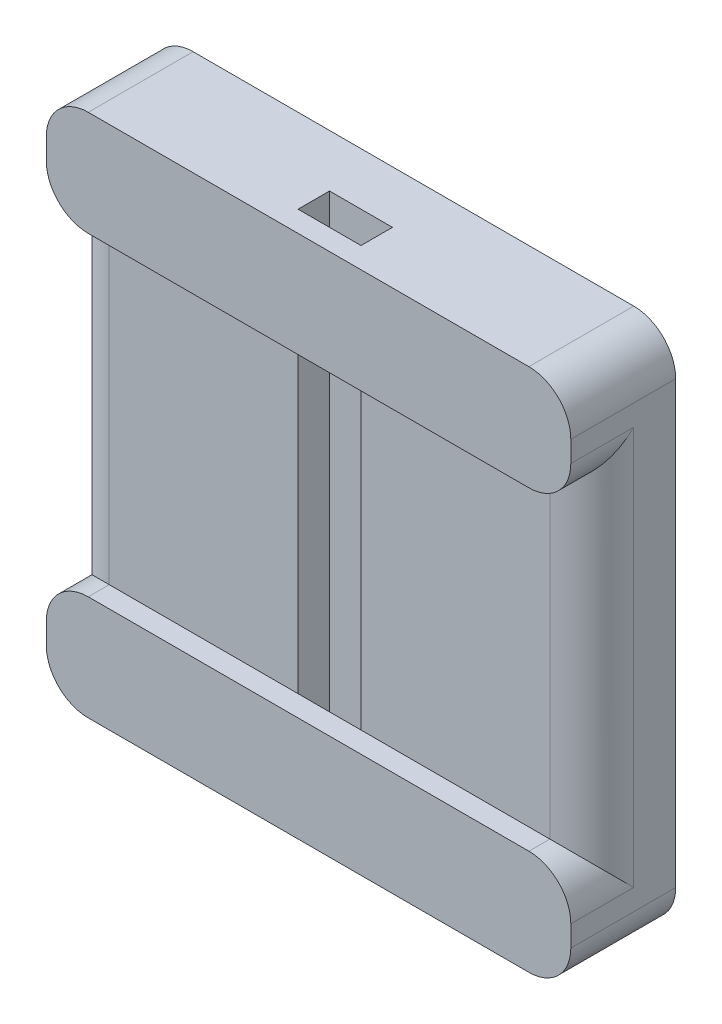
ISO-10303-21;
HEADER;
FILE_DESCRIPTION(('STEP AP214'),'2;1');
FILE_NAME('part.step','',(''),(''),'','','');
FILE_SCHEMA(('AUTOMOTIVE_DESIGN { 1 0 10303 214 1 1 1 1 }'));
ENDSEC;
DATA;
#1=APPLICATION_CONTEXT('core data for automotive mechanical design processes');
#2=APPLICATION_PROTOCOL_DEFINITION('international standard','automotive_design',2000,#1);
#3=PRODUCT_CONTEXT('',#1,'mechanical');
#4=PRODUCT('Part','Part','',(#3));
#5=PRODUCT_RELATED_PRODUCT_CATEGORY('part','',(#4));
#6=PRODUCT_DEFINITION_FORMATION('','',#4);
#7=PRODUCT_DEFINITION_CONTEXT('part definition',#1,'design');
#8=PRODUCT_DEFINITION('design','',#6,#7);
#9=PRODUCT_DEFINITION_SHAPE('','',#8);
#10=(LENGTH_UNIT() NAMED_UNIT(*) SI_UNIT(.MILLI.,.METRE.));
#11=(NAMED_UNIT(*) PLANE_ANGLE_UNIT() SI_UNIT($,.RADIAN.));
#12=(NAMED_UNIT(*) SI_UNIT($,.STERADIAN.) SOLID_ANGLE_UNIT());
#13=UNCERTAINTY_MEASURE_WITH_UNIT(LENGTH_MEASURE(1.E-05),#10,'distance_accuracy_value','');
#14=(GEOMETRIC_REPRESENTATION_CONTEXT(3) GLOBAL_UNCERTAINTY_ASSIGNED_CONTEXT((#13)) GLOBAL_UNIT_ASSIGNED_CONTEXT((#10,
#11,#12)) REPRESENTATION_CONTEXT('',''));
#15=CARTESIAN_POINT('',(0.,0.,0.));
#16=DIRECTION('',(0.,0.,1.));
#17=DIRECTION('',(1.,0.,0.));
#18=AXIS2_PLACEMENT_3D('',#15,#16,#17);
#19=CARTESIAN_POINT('',(0.,0.,4.));
#20=DIRECTION('',(0.,0.,-1.));
#21=DIRECTION('',(-1.,0.,0.));
#22=AXIS2_PLACEMENT_3D('',#19,#20,#21);
#23=PLANE('',#22);
#24=DIRECTION('',(1.,0.,0.));
#25=VECTOR('',#24,1.);
#26=CARTESIAN_POINT('',(0.,20.,4.));
#27=LINE('',#26,#25);
#28=CARTESIAN_POINT('',(2.,20.,4.));
#29=VERTEX_POINT('',#28);
#30=CARTESIAN_POINT('',(11.,20.,4.));
#31=VERTEX_POINT('',#30);
#32=EDGE_CURVE('E257',#29,#31,#27,.T.);
#33=ORIENTED_EDGE('',*,*,#32,.F.);
#34=DIRECTION('',(0.,-1.,0.));
#35=VECTOR('',#34,1.);
#36=CARTESIAN_POINT('',(2.,0.,4.));
#37=LINE('',#36,#35);
#38=CARTESIAN_POINT('',(2.,5.,4.));
#39=VERTEX_POINT('',#38);
#40=EDGE_CURVE('E341',#29,#39,#37,.T.);
#41=ORIENTED_EDGE('',*,*,#40,.T.);
#42=DIRECTION('',(-1.,0.,0.));
#43=VECTOR('',#42,1.);
#44=CARTESIAN_POINT('',(0.,5.,4.));
#45=LINE('',#44,#43);
#46=CARTESIAN_POINT('',(11.,5.,4.));
#47=VERTEX_POINT('',#46);
#48=EDGE_CURVE('E236',#47,#39,#45,.T.);
#49=ORIENTED_EDGE('',*,*,#48,.F.);
#50=DIRECTION('',(0.,-1.,0.));
#51=VECTOR('',#50,1.);
#52=CARTESIAN_POINT('',(11.,25.,4.));
#53=LINE('',#52,#51);
#54=EDGE_CURVE('E228',#31,#47,#53,.T.);
#55=ORIENTED_EDGE('',*,*,#54,.F.);
#56=EDGE_LOOP('',(#33,#41,#49,#55));
#57=FACE_BOUND('',#56,.T.);
#58=ADVANCED_FACE('F33',(#57),#23,.F.);
#59=CARTESIAN_POINT('',(23.,5.,4.));
#60=VERTEX_POINT('',#59);
#61=CARTESIAN_POINT('',(14.,5.,4.));
#62=VERTEX_POINT('',#61);
#63=EDGE_CURVE('E241',#60,#62,#45,.T.);
#64=ORIENTED_EDGE('',*,*,#63,.F.);
#65=DIRECTION('',(0.,1.,0.));
#66=VECTOR('',#65,1.);
#67=CARTESIAN_POINT('',(23.,0.,4.));
#68=LINE('',#67,#66);
#69=CARTESIAN_POINT('',(23.,20.,4.));
#70=VERTEX_POINT('',#69);
#71=EDGE_CURVE('E11',#60,#70,#68,.T.);
#72=ORIENTED_EDGE('',*,*,#71,.T.);
#73=CARTESIAN_POINT('',(14.,20.,4.));
#74=VERTEX_POINT('',#73);
#75=EDGE_CURVE('E250',#74,#70,#27,.T.);
#76=ORIENTED_EDGE('',*,*,#75,.F.);
#77=DIRECTION('',(0.,-1.,0.));
#78=VECTOR('',#77,1.);
#79=CARTESIAN_POINT('',(14.,25.,4.));
#80=LINE('',#79,#78);
#81=EDGE_CURVE('E233',#74,#62,#80,.T.);
#82=ORIENTED_EDGE('',*,*,#81,.T.);
#83=EDGE_LOOP('',(#64,#72,#76,#82));
#84=FACE_BOUND('',#83,.T.);
#85=ADVANCED_FACE('F412',(#84),#23,.F.);
#86=CARTESIAN_POINT('',(0.,0.,4.));
#87=DIRECTION('',(1.,0.,0.));
#88=DIRECTION('',(0.,0.,-1.));
#89=AXIS2_PLACEMENT_3D('',#86,#87,#88);
#90=PLANE('',#89);
#91=DIRECTION('',(0.,-1.,0.));
#92=VECTOR('',#91,1.);
#93=CARTESIAN_POINT('',(0.,25.,5.));
#94=LINE('',#93,#92);
#95=CARTESIAN_POINT('',(0.,23.,5.));
#96=VERTEX_POINT('',#95);
#97=CARTESIAN_POINT('',(0.,22.,5.));
#98=VERTEX_POINT('',#97);
#99=EDGE_CURVE('E253',#96,#98,#94,.T.);
#100=ORIENTED_EDGE('',*,*,#99,.F.);
#101=DIRECTION('',(0.,0.,-1.));
#102=VECTOR('',#101,1.);
#103=CARTESIAN_POINT('',(0.,23.,4.));
#104=LINE('',#103,#102);
#105=CARTESIAN_POINT('',(0.,23.,0.));
#106=VERTEX_POINT('',#105);
#107=EDGE_CURVE('E288',#96,#106,#104,.T.);
#108=ORIENTED_EDGE('',*,*,#107,.T.);
#109=DIRECTION('',(0.,-1.,0.));
#110=VECTOR('',#109,1.);
#111=CARTESIAN_POINT('',(0.,0.,0.));
#112=LINE('',#111,#110);
#113=CARTESIAN_POINT('',(0.,2.,0.));
#114=VERTEX_POINT('',#113);
#115=EDGE_CURVE('E266',#106,#114,#112,.T.);
#116=ORIENTED_EDGE('',*,*,#115,.T.);
#117=DIRECTION('',(0.,0.,-1.));
#118=VECTOR('',#117,1.);
#119=CARTESIAN_POINT('',(0.,2.,4.));
#120=LINE('',#119,#118);
#121=CARTESIAN_POINT('',(0.,2.,5.));
#122=VERTEX_POINT('',#121);
#123=EDGE_CURVE('E286',#114,#122,#120,.F.);
#124=ORIENTED_EDGE('',*,*,#123,.T.);
#125=DIRECTION('',(0.,-1.,0.));
#126=VECTOR('',#125,1.);
#127=CARTESIAN_POINT('',(0.,0.,5.));
#128=LINE('',#127,#126);
#129=CARTESIAN_POINT('',(0.,3.,5.));
#130=VERTEX_POINT('',#129);
#131=EDGE_CURVE('E237',#130,#122,#128,.T.);
#132=ORIENTED_EDGE('',*,*,#131,.F.);
#133=DIRECTION('',(0.,0.,-1.));
#134=VECTOR('',#133,1.);
#135=CARTESIAN_POINT('',(0.,3.,4.));
#136=LINE('',#135,#134);
#137=CARTESIAN_POINT('',(0.,3.,2.));
#138=VERTEX_POINT('',#137);
#139=EDGE_CURVE('E283',#130,#138,#136,.T.);
#140=ORIENTED_EDGE('',*,*,#139,.T.);
#141=DIRECTION('',(0.,-1.,0.));
#142=VECTOR('',#141,1.);
#143=CARTESIAN_POINT('',(0.,0.,2.));
#144=LINE('',#143,#142);
#145=CARTESIAN_POINT('',(0.,22.,2.));
#146=VERTEX_POINT('',#145);
#147=EDGE_CURVE('E281',#138,#146,#144,.F.);
#148=ORIENTED_EDGE('',*,*,#147,.T.);
#149=DIRECTION('',(0.,0.,-1.));
#150=VECTOR('',#149,1.);
#151=CARTESIAN_POINT('',(0.,22.,4.));
#152=LINE('',#151,#150);
#153=EDGE_CURVE('E279',#146,#98,#152,.F.);
#154=ORIENTED_EDGE('',*,*,#153,.T.);
#155=EDGE_LOOP('',(#100,#108,#116,#124,#132,#140,#148,#154));
#156=FACE_BOUND('',#155,.T.);
#157=ADVANCED_FACE('F396',(#156),#90,.F.);
#158=CARTESIAN_POINT('',(0.,0.,4.));
#159=DIRECTION('',(0.,1.,0.));
#160=DIRECTION('',(0.,0.,1.));
#161=AXIS2_PLACEMENT_3D('',#158,#159,#160);
#162=PLANE('',#161);
#163=DIRECTION('',(1.,0.,0.));
#164=VECTOR('',#163,1.);
#165=CARTESIAN_POINT('',(11.,0.,2.50000000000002));
#166=LINE('',#165,#164);
#167=CARTESIAN_POINT('',(11.,0.,2.50000000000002));
#168=VERTEX_POINT('',#167);
#169=CARTESIAN_POINT('',(14.,0.,2.50000000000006));
#170=VERTEX_POINT('',#169);
#171=EDGE_CURVE('E211',#168,#170,#166,.T.);
#172=ORIENTED_EDGE('',*,*,#171,.F.);
#173=DIRECTION('',(0.,0.,-1.));
#174=VECTOR('',#173,1.);
#175=CARTESIAN_POINT('',(11.,0.,4.));
#176=LINE('',#175,#174);
#177=CARTESIAN_POINT('',(11.,0.,4.));
#178=VERTEX_POINT('',#177);
#179=EDGE_CURVE('E202',#178,#168,#176,.T.);
#180=ORIENTED_EDGE('',*,*,#179,.F.);
#181=DIRECTION('',(-1.,0.,0.));
#182=VECTOR('',#181,1.);
#183=CARTESIAN_POINT('',(11.,0.,4.));
#184=LINE('',#183,#182);
#185=CARTESIAN_POINT('',(14.,0.,4.));
#186=VERTEX_POINT('',#185);
#187=EDGE_CURVE('E196',#186,#178,#184,.T.);
#188=ORIENTED_EDGE('',*,*,#187,.F.);
#189=DIRECTION('',(0.,0.,1.));
#190=VECTOR('',#189,1.);
#191=CARTESIAN_POINT('',(14.,0.,4.));
#192=LINE('',#191,#190);
#193=EDGE_CURVE('E221',#170,#186,#192,.T.);
#194=ORIENTED_EDGE('',*,*,#193,.F.);
#195=EDGE_LOOP('',(#172,#180,#188,#194));
#196=FACE_BOUND('',#195,.T.);
#197=DIRECTION('',(1.,0.,0.));
#198=VECTOR('',#197,1.);
#199=CARTESIAN_POINT('',(0.,0.,0.));
#200=LINE('',#199,#198);
#201=CARTESIAN_POINT('',(2.,0.,0.));
#202=VERTEX_POINT('',#201);
#203=CARTESIAN_POINT('',(23.,0.,0.));
#204=VERTEX_POINT('',#203);
#205=EDGE_CURVE('E270',#202,#204,#200,.T.);
#206=ORIENTED_EDGE('',*,*,#205,.T.);
#207=DIRECTION('',(0.,0.,-1.));
#208=VECTOR('',#207,1.);
#209=CARTESIAN_POINT('',(23.,0.,4.));
#210=LINE('',#209,#208);
#211=CARTESIAN_POINT('',(23.,0.,5.));
#212=VERTEX_POINT('',#211);
#213=EDGE_CURVE('E327',#204,#212,#210,.F.);
#214=ORIENTED_EDGE('',*,*,#213,.T.);
#215=DIRECTION('',(1.,0.,0.));
#216=VECTOR('',#215,1.);
#217=CARTESIAN_POINT('',(25.,0.,5.));
#218=LINE('',#217,#216);
#219=CARTESIAN_POINT('',(2.,0.,5.));
#220=VERTEX_POINT('',#219);
#221=EDGE_CURVE('E240',#220,#212,#218,.T.);
#222=ORIENTED_EDGE('',*,*,#221,.F.);
#223=DIRECTION('',(0.,0.,-1.));
#224=VECTOR('',#223,1.);
#225=CARTESIAN_POINT('',(2.,0.,4.));
#226=LINE('',#225,#224);
#227=EDGE_CURVE('E324',#220,#202,#226,.T.);
#228=ORIENTED_EDGE('',*,*,#227,.T.);
#229=EDGE_LOOP('',(#206,#214,#222,#228));
#230=FACE_BOUND('',#229,.T.);
#231=ADVANCED_FACE('F403',(#196,#230),#162,.F.);
#232=CARTESIAN_POINT('',(25.,0.,4.));
#233=DIRECTION('',(-1.,0.,0.));
#234=DIRECTION('',(0.,0.,1.));
#235=AXIS2_PLACEMENT_3D('',#232,#233,#234);
#236=PLANE('',#235);
#237=DIRECTION('',(0.,1.,0.));
#238=VECTOR('',#237,1.);
#239=CARTESIAN_POINT('',(25.,0.,0.));
#240=LINE('',#239,#238);
#241=CARTESIAN_POINT('',(25.,2.,0.));
#242=VERTEX_POINT('',#241);
#243=CARTESIAN_POINT('',(25.,23.,0.));
#244=VERTEX_POINT('',#243);
#245=EDGE_CURVE('E273',#242,#244,#240,.T.);
#246=ORIENTED_EDGE('',*,*,#245,.T.);
#247=DIRECTION('',(0.,0.,-1.));
#248=VECTOR('',#247,1.);
#249=CARTESIAN_POINT('',(25.,23.,4.));
#250=LINE('',#249,#248);
#251=CARTESIAN_POINT('',(25.,23.,5.));
#252=VERTEX_POINT('',#251);
#253=EDGE_CURVE('E322',#244,#252,#250,.F.);
#254=ORIENTED_EDGE('',*,*,#253,.T.);
#255=DIRECTION('',(0.,1.,0.));
#256=VECTOR('',#255,1.);
#257=CARTESIAN_POINT('',(25.,20.,5.));
#258=LINE('',#257,#256);
#259=CARTESIAN_POINT('',(25.,22.,5.));
#260=VERTEX_POINT('',#259);
#261=EDGE_CURVE('E260',#260,#252,#258,.T.);
#262=ORIENTED_EDGE('',*,*,#261,.F.);
#263=DIRECTION('',(0.,0.,-1.));
#264=VECTOR('',#263,1.);
#265=CARTESIAN_POINT('',(25.,22.,4.));
#266=LINE('',#265,#264);
#267=CARTESIAN_POINT('',(25.,22.,2.));
#268=VERTEX_POINT('',#267);
#269=EDGE_CURVE('E316',#260,#268,#266,.T.);
#270=ORIENTED_EDGE('',*,*,#269,.T.);
#271=DIRECTION('',(0.,1.,0.));
#272=VECTOR('',#271,1.);
#273=CARTESIAN_POINT('',(25.,0.,2.));
#274=LINE('',#273,#272);
#275=CARTESIAN_POINT('',(25.,3.,2.));
#276=VERTEX_POINT('',#275);
#277=EDGE_CURVE('E314',#268,#276,#274,.F.);
#278=ORIENTED_EDGE('',*,*,#277,.T.);
#279=DIRECTION('',(0.,0.,-1.));
#280=VECTOR('',#279,1.);
#281=CARTESIAN_POINT('',(25.,3.,4.));
#282=LINE('',#281,#280);
#283=CARTESIAN_POINT('',(25.,3.,5.));
#284=VERTEX_POINT('',#283);
#285=EDGE_CURVE('E312',#276,#284,#282,.F.);
#286=ORIENTED_EDGE('',*,*,#285,.T.);
#287=DIRECTION('',(0.,1.,0.));
#288=VECTOR('',#287,1.);
#289=CARTESIAN_POINT('',(25.,5.,5.));
#290=LINE('',#289,#288);
#291=CARTESIAN_POINT('',(25.,2.,5.));
#292=VERTEX_POINT('',#291);
#293=EDGE_CURVE('E244',#292,#284,#290,.T.);
#294=ORIENTED_EDGE('',*,*,#293,.F.);
#295=DIRECTION('',(0.,0.,-1.));
#296=VECTOR('',#295,1.);
#297=CARTESIAN_POINT('',(25.,2.,4.));
#298=LINE('',#297,#296);
#299=EDGE_CURVE('E319',#292,#242,#298,.T.);
#300=ORIENTED_EDGE('',*,*,#299,.T.);
#301=EDGE_LOOP('',(#246,#254,#262,#270,#278,#286,#294,#300));
#302=FACE_BOUND('',#301,.T.);
#303=ADVANCED_FACE('F365',(#302),#236,.F.);
#304=CARTESIAN_POINT('',(0.,25.,4.));
#305=DIRECTION('',(0.,-1.,0.));
#306=DIRECTION('',(0.,0.,-1.));
#307=AXIS2_PLACEMENT_3D('',#304,#305,#306);
#308=PLANE('',#307);
#309=DIRECTION('',(0.,0.,-1.));
#310=VECTOR('',#309,1.);
#311=CARTESIAN_POINT('',(11.,25.,4.));
#312=LINE('',#311,#310);
#313=CARTESIAN_POINT('',(11.,25.,4.));
#314=VERTEX_POINT('',#313);
#315=CARTESIAN_POINT('',(11.,25.,2.50000000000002));
#316=VERTEX_POINT('',#315);
#317=EDGE_CURVE('E185',#314,#316,#312,.T.);
#318=ORIENTED_EDGE('',*,*,#317,.T.);
#319=DIRECTION('',(1.,0.,0.));
#320=VECTOR('',#319,1.);
#321=CARTESIAN_POINT('',(11.,25.,2.50000000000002));
#322=LINE('',#321,#320);
#323=CARTESIAN_POINT('',(14.,25.,2.50000000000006));
#324=VERTEX_POINT('',#323);
#325=EDGE_CURVE('E190',#316,#324,#322,.T.);
#326=ORIENTED_EDGE('',*,*,#325,.T.);
#327=DIRECTION('',(0.,0.,1.));
#328=VECTOR('',#327,1.);
#329=CARTESIAN_POINT('',(14.,25.,4.));
#330=LINE('',#329,#328);
#331=CARTESIAN_POINT('',(14.,25.,4.));
#332=VERTEX_POINT('',#331);
#333=EDGE_CURVE('E195',#324,#332,#330,.T.);
#334=ORIENTED_EDGE('',*,*,#333,.T.);
#335=DIRECTION('',(-1.,0.,0.));
#336=VECTOR('',#335,1.);
#337=CARTESIAN_POINT('',(11.,25.,4.));
#338=LINE('',#337,#336);
#339=EDGE_CURVE('E192',#332,#314,#338,.T.);
#340=ORIENTED_EDGE('',*,*,#339,.T.);
#341=EDGE_LOOP('',(#318,#326,#334,#340));
#342=FACE_BOUND('',#341,.T.);
#343=DIRECTION('',(-1.,0.,0.));
#344=VECTOR('',#343,1.);
#345=CARTESIAN_POINT('',(0.,25.,0.));
#346=LINE('',#345,#344);
#347=CARTESIAN_POINT('',(23.,25.,0.));
#348=VERTEX_POINT('',#347);
#349=CARTESIAN_POINT('',(2.,25.,0.));
#350=VERTEX_POINT('',#349);
#351=EDGE_CURVE('E276',#348,#350,#346,.T.);
#352=ORIENTED_EDGE('',*,*,#351,.T.);
#353=DIRECTION('',(0.,0.,-1.));
#354=VECTOR('',#353,1.);
#355=CARTESIAN_POINT('',(2.,25.,4.));
#356=LINE('',#355,#354);
#357=CARTESIAN_POINT('',(2.,25.,5.));
#358=VERTEX_POINT('',#357);
#359=EDGE_CURVE('E302',#350,#358,#356,.F.);
#360=ORIENTED_EDGE('',*,*,#359,.T.);
#361=DIRECTION('',(-1.,0.,0.));
#362=VECTOR('',#361,1.);
#363=CARTESIAN_POINT('',(25.,25.,5.));
#364=LINE('',#363,#362);
#365=CARTESIAN_POINT('',(23.,25.,5.));
#366=VERTEX_POINT('',#365);
#367=EDGE_CURVE('E263',#366,#358,#364,.T.);
#368=ORIENTED_EDGE('',*,*,#367,.F.);
#369=DIRECTION('',(0.,0.,-1.));
#370=VECTOR('',#369,1.);
#371=CARTESIAN_POINT('',(23.,25.,4.));
#372=LINE('',#371,#370);
#373=EDGE_CURVE('E299',#366,#348,#372,.T.);
#374=ORIENTED_EDGE('',*,*,#373,.T.);
#375=EDGE_LOOP('',(#352,#360,#368,#374));
#376=FACE_BOUND('',#375,.T.);
#377=ADVANCED_FACE('F187',(#342,#376),#308,.F.);
#378=CARTESIAN_POINT('',(0.,0.,0.));
#379=DIRECTION('',(0.,0.,-1.));
#380=DIRECTION('',(-1.,0.,0.));
#381=AXIS2_PLACEMENT_3D('',#378,#379,#380);
#382=PLANE('',#381);
#383=ORIENTED_EDGE('',*,*,#115,.F.);
#384=CARTESIAN_POINT('',(2.,23.,0.));
#385=DIRECTION('',(0.,0.,-1.));
#386=DIRECTION('',(-1.,0.,0.));
#387=AXIS2_PLACEMENT_3D('',#384,#385,#386);
#388=CIRCLE('',#387,2.);
#389=EDGE_CURVE('E297',#106,#350,#388,.T.);
#390=ORIENTED_EDGE('',*,*,#389,.T.);
#391=ORIENTED_EDGE('',*,*,#351,.F.);
#392=CARTESIAN_POINT('',(23.,23.,0.));
#393=DIRECTION('',(0.,0.,-1.));
#394=DIRECTION('',(-1.,0.,0.));
#395=AXIS2_PLACEMENT_3D('',#392,#393,#394);
#396=CIRCLE('',#395,2.);
#397=EDGE_CURVE('E295',#348,#244,#396,.T.);
#398=ORIENTED_EDGE('',*,*,#397,.T.);
#399=ORIENTED_EDGE('',*,*,#245,.F.);
#400=CARTESIAN_POINT('',(23.,2.,0.));
#401=DIRECTION('',(0.,0.,-1.));
#402=DIRECTION('',(-1.,0.,0.));
#403=AXIS2_PLACEMENT_3D('',#400,#401,#402);
#404=CIRCLE('',#403,2.);
#405=EDGE_CURVE('E293',#242,#204,#404,.T.);
#406=ORIENTED_EDGE('',*,*,#405,.T.);
#407=ORIENTED_EDGE('',*,*,#205,.F.);
#408=CARTESIAN_POINT('',(2.,2.,0.));
#409=DIRECTION('',(0.,0.,-1.));
#410=DIRECTION('',(-1.,0.,0.));
#411=AXIS2_PLACEMENT_3D('',#408,#409,#410);
#412=CIRCLE('',#411,2.);
#413=EDGE_CURVE('E291',#202,#114,#412,.T.);
#414=ORIENTED_EDGE('',*,*,#413,.T.);
#415=EDGE_LOOP('',(#383,#390,#391,#398,#399,#406,#407,#414));
#416=FACE_BOUND('',#415,.T.);
#417=ADVANCED_FACE('F379',(#416),#382,.T.);
#418=CARTESIAN_POINT('',(0.,20.,5.));
#419=DIRECTION('',(0.,1.,0.));
#420=DIRECTION('',(0.,0.,1.));
#421=AXIS2_PLACEMENT_3D('',#418,#419,#420);
#422=PLANE('',#421);
#423=DIRECTION('',(1.,0.,0.));
#424=VECTOR('',#423,1.);
#425=CARTESIAN_POINT('',(0.,20.,5.));
#426=LINE('',#425,#424);
#427=CARTESIAN_POINT('',(2.,20.,5.));
#428=VERTEX_POINT('',#427);
#429=CARTESIAN_POINT('',(23.,20.,5.));
#430=VERTEX_POINT('',#429);
#431=EDGE_CURVE('E256',#428,#430,#426,.T.);
#432=ORIENTED_EDGE('',*,*,#431,.F.);
#433=DIRECTION('',(0.,0.,-1.));
#434=VECTOR('',#433,1.);
#435=CARTESIAN_POINT('',(2.,20.,5.));
#436=LINE('',#435,#434);
#437=EDGE_CURVE('E42',#428,#29,#436,.T.);
#438=ORIENTED_EDGE('',*,*,#437,.T.);
#439=ORIENTED_EDGE('',*,*,#32,.T.);
#440=DIRECTION('',(1.,0.,0.));
#441=VECTOR('',#440,1.);
#442=CARTESIAN_POINT('',(0.,20.,4.));
#443=LINE('',#442,#441);
#444=EDGE_CURVE('E227',#31,#74,#443,.T.);
#445=ORIENTED_EDGE('',*,*,#444,.T.);
#446=ORIENTED_EDGE('',*,*,#75,.T.);
#447=DIRECTION('',(0.,0.,-1.));
#448=VECTOR('',#447,1.);
#449=CARTESIAN_POINT('',(23.,20.,5.));
#450=LINE('',#449,#448);
#451=EDGE_CURVE('E343',#70,#430,#450,.F.);
#452=ORIENTED_EDGE('',*,*,#451,.T.);
#453=EDGE_LOOP('',(#432,#438,#439,#445,#446,#452));
#454=FACE_BOUND('',#453,.T.);
#455=ADVANCED_FACE('F422',(#454),#422,.F.);
#456=CARTESIAN_POINT('',(0.,0.,5.));
#457=DIRECTION('',(0.,0.,1.));
#458=DIRECTION('',(1.,0.,0.));
#459=AXIS2_PLACEMENT_3D('',#456,#457,#458);
#460=PLANE('',#459);
#461=ORIENTED_EDGE('',*,*,#367,.T.);
#462=CARTESIAN_POINT('',(2.,23.,5.));
#463=DIRECTION('',(0.,0.,1.));
#464=DIRECTION('',(1.,0.,0.));
#465=AXIS2_PLACEMENT_3D('',#462,#463,#464);
#466=CIRCLE('',#465,2.);
#467=EDGE_CURVE('E310',#358,#96,#466,.T.);
#468=ORIENTED_EDGE('',*,*,#467,.T.);
#469=ORIENTED_EDGE('',*,*,#99,.T.);
#470=CARTESIAN_POINT('',(2.,22.,5.));
#471=DIRECTION('',(0.,0.,1.));
#472=DIRECTION('',(1.,0.,0.));
#473=AXIS2_PLACEMENT_3D('',#470,#471,#472);
#474=CIRCLE('',#473,2.);
#475=EDGE_CURVE('E306',#98,#428,#474,.T.);
#476=ORIENTED_EDGE('',*,*,#475,.T.);
#477=ORIENTED_EDGE('',*,*,#431,.T.);
#478=CARTESIAN_POINT('',(23.,22.,5.));
#479=DIRECTION('',(0.,0.,1.));
#480=DIRECTION('',(1.,0.,0.));
#481=AXIS2_PLACEMENT_3D('',#478,#479,#480);
#482=CIRCLE('',#481,2.);
#483=EDGE_CURVE('E304',#430,#260,#482,.T.);
#484=ORIENTED_EDGE('',*,*,#483,.T.);
#485=ORIENTED_EDGE('',*,*,#261,.T.);
#486=CARTESIAN_POINT('',(23.,23.,5.));
#487=DIRECTION('',(0.,0.,1.));
#488=DIRECTION('',(1.,0.,0.));
#489=AXIS2_PLACEMENT_3D('',#486,#487,#488);
#490=CIRCLE('',#489,2.);
#491=EDGE_CURVE('E308',#252,#366,#490,.T.);
#492=ORIENTED_EDGE('',*,*,#491,.T.);
#493=EDGE_LOOP('',(#461,#468,#469,#476,#477,#484,#485,#492));
#494=FACE_BOUND('',#493,.T.);
#495=ADVANCED_FACE('F390',(#494),#460,.T.);
#496=CARTESIAN_POINT('',(0.,5.,5.));
#497=DIRECTION('',(0.,-1.,0.));
#498=DIRECTION('',(1.,0.,0.));
#499=AXIS2_PLACEMENT_3D('',#496,#497,#498);
#500=PLANE('',#499);
#501=ORIENTED_EDGE('',*,*,#48,.T.);
#502=DIRECTION('',(0.,0.,-1.));
#503=VECTOR('',#502,1.);
#504=CARTESIAN_POINT('',(2.,5.,5.));
#505=LINE('',#504,#503);
#506=CARTESIAN_POINT('',(2.,5.,5.));
#507=VERTEX_POINT('',#506);
#508=EDGE_CURVE('E339',#39,#507,#505,.F.);
#509=ORIENTED_EDGE('',*,*,#508,.T.);
#510=DIRECTION('',(-1.,0.,0.));
#511=VECTOR('',#510,1.);
#512=CARTESIAN_POINT('',(0.,5.,5.));
#513=LINE('',#512,#511);
#514=CARTESIAN_POINT('',(23.,5.,5.));
#515=VERTEX_POINT('',#514);
#516=EDGE_CURVE('E247',#515,#507,#513,.T.);
#517=ORIENTED_EDGE('',*,*,#516,.F.);
#518=DIRECTION('',(0.,0.,-1.));
#519=VECTOR('',#518,1.);
#520=CARTESIAN_POINT('',(23.,5.,5.));
#521=LINE('',#520,#519);
#522=EDGE_CURVE('E337',#515,#60,#521,.T.);
#523=ORIENTED_EDGE('',*,*,#522,.T.);
#524=ORIENTED_EDGE('',*,*,#63,.T.);
#525=EDGE_CURVE('E252',#62,#47,#45,.T.);
#526=ORIENTED_EDGE('',*,*,#525,.T.);
#527=EDGE_LOOP('',(#501,#509,#517,#523,#524,#526));
#528=FACE_BOUND('',#527,.T.);
#529=ADVANCED_FACE('F446',(#528),#500,.F.);
#530=CARTESIAN_POINT('',(0.,0.,5.));
#531=DIRECTION('',(0.,0.,-1.));
#532=DIRECTION('',(-1.,0.,0.));
#533=AXIS2_PLACEMENT_3D('',#530,#531,#532);
#534=PLANE('',#533);
#535=ORIENTED_EDGE('',*,*,#221,.T.);
#536=CARTESIAN_POINT('',(23.,2.,5.));
#537=DIRECTION('',(0.,0.,-1.));
#538=DIRECTION('',(-1.,0.,0.));
#539=AXIS2_PLACEMENT_3D('',#536,#537,#538);
#540=CIRCLE('',#539,2.);
#541=EDGE_CURVE('E335',#212,#292,#540,.F.);
#542=ORIENTED_EDGE('',*,*,#541,.T.);
#543=ORIENTED_EDGE('',*,*,#293,.T.);
#544=CARTESIAN_POINT('',(23.,3.,5.));
#545=DIRECTION('',(0.,0.,-1.));
#546=DIRECTION('',(-1.,0.,0.));
#547=AXIS2_PLACEMENT_3D('',#544,#545,#546);
#548=CIRCLE('',#547,2.);
#549=EDGE_CURVE('E329',#284,#515,#548,.F.);
#550=ORIENTED_EDGE('',*,*,#549,.T.);
#551=ORIENTED_EDGE('',*,*,#516,.T.);
#552=CARTESIAN_POINT('',(2.,3.,5.));
#553=DIRECTION('',(0.,0.,-1.));
#554=DIRECTION('',(-1.,0.,0.));
#555=AXIS2_PLACEMENT_3D('',#552,#553,#554);
#556=CIRCLE('',#555,2.);
#557=EDGE_CURVE('E331',#507,#130,#556,.F.);
#558=ORIENTED_EDGE('',*,*,#557,.T.);
#559=ORIENTED_EDGE('',*,*,#131,.T.);
#560=CARTESIAN_POINT('',(2.,2.,5.));
#561=DIRECTION('',(0.,0.,-1.));
#562=DIRECTION('',(-1.,0.,0.));
#563=AXIS2_PLACEMENT_3D('',#560,#561,#562);
#564=CIRCLE('',#563,2.);
#565=EDGE_CURVE('E333',#122,#220,#564,.F.);
#566=ORIENTED_EDGE('',*,*,#565,.T.);
#567=EDGE_LOOP('',(#535,#542,#543,#550,#551,#558,#559,#566));
#568=FACE_BOUND('',#567,.T.);
#569=ADVANCED_FACE('F368',(#568),#534,.F.);
#570=CARTESIAN_POINT('',(11.,25.,4.));
#571=DIRECTION('',(0.,0.,1.));
#572=DIRECTION('',(1.,0.,0.));
#573=AXIS2_PLACEMENT_3D('',#570,#571,#572);
#574=PLANE('',#573);
#575=EDGE_CURVE('E225',#314,#31,#53,.T.);
#576=ORIENTED_EDGE('',*,*,#575,.F.);
#577=ORIENTED_EDGE('',*,*,#339,.F.);
#578=EDGE_CURVE('E230',#332,#74,#80,.T.);
#579=ORIENTED_EDGE('',*,*,#578,.T.);
#580=ORIENTED_EDGE('',*,*,#444,.F.);
#581=EDGE_LOOP('',(#576,#577,#579,#580));
#582=FACE_BOUND('',#581,.T.);
#583=ADVANCED_FACE('F459',(#582),#574,.F.);
#584=EDGE_CURVE('E219',#62,#186,#80,.T.);
#585=ORIENTED_EDGE('',*,*,#584,.T.);
#586=ORIENTED_EDGE('',*,*,#187,.T.);
#587=EDGE_CURVE('E229',#47,#178,#53,.T.);
#588=ORIENTED_EDGE('',*,*,#587,.F.);
#589=ORIENTED_EDGE('',*,*,#525,.F.);
#590=EDGE_LOOP('',(#585,#586,#588,#589));
#591=FACE_BOUND('',#590,.T.);
#592=ADVANCED_FACE('F467',(#591),#574,.F.);
#593=CARTESIAN_POINT('',(11.,25.,4.));
#594=DIRECTION('',(-1.,0.,0.));
#595=DIRECTION('',(0.,0.,1.));
#596=AXIS2_PLACEMENT_3D('',#593,#594,#595);
#597=PLANE('',#596);
#598=ORIENTED_EDGE('',*,*,#179,.T.);
#599=DIRECTION('',(0.,-1.,0.));
#600=VECTOR('',#599,1.);
#601=CARTESIAN_POINT('',(11.,25.,2.50000000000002));
#602=LINE('',#601,#600);
#603=EDGE_CURVE('E199',#316,#168,#602,.T.);
#604=ORIENTED_EDGE('',*,*,#603,.F.);
#605=ORIENTED_EDGE('',*,*,#317,.F.);
#606=ORIENTED_EDGE('',*,*,#575,.T.);
#607=ORIENTED_EDGE('',*,*,#54,.T.);
#608=ORIENTED_EDGE('',*,*,#587,.T.);
#609=EDGE_LOOP('',(#598,#604,#605,#606,#607,#608));
#610=FACE_BOUND('',#609,.T.);
#611=ADVANCED_FACE('F200',(#610),#597,.F.);
#612=CARTESIAN_POINT('',(14.,25.,4.));
#613=DIRECTION('',(1.,0.,0.));
#614=DIRECTION('',(0.,0.,-1.));
#615=AXIS2_PLACEMENT_3D('',#612,#613,#614);
#616=PLANE('',#615);
#617=ORIENTED_EDGE('',*,*,#578,.F.);
#618=ORIENTED_EDGE('',*,*,#333,.F.);
#619=DIRECTION('',(0.,-1.,0.));
#620=VECTOR('',#619,1.);
#621=CARTESIAN_POINT('',(14.,25.,2.50000000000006));
#622=LINE('',#621,#620);
#623=EDGE_CURVE('E206',#324,#170,#622,.T.);
#624=ORIENTED_EDGE('',*,*,#623,.T.);
#625=ORIENTED_EDGE('',*,*,#193,.T.);
#626=ORIENTED_EDGE('',*,*,#584,.F.);
#627=ORIENTED_EDGE('',*,*,#81,.F.);
#628=EDGE_LOOP('',(#617,#618,#624,#625,#626,#627));
#629=FACE_BOUND('',#628,.T.);
#630=ADVANCED_FACE('F481',(#629),#616,.F.);
#631=CARTESIAN_POINT('',(11.,25.,2.50000000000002));
#632=DIRECTION('',(0.,0.,-1.));
#633=DIRECTION('',(-1.,0.,0.));
#634=AXIS2_PLACEMENT_3D('',#631,#632,#633);
#635=PLANE('',#634);
#636=ORIENTED_EDGE('',*,*,#171,.T.);
#637=ORIENTED_EDGE('',*,*,#623,.F.);
#638=ORIENTED_EDGE('',*,*,#325,.F.);
#639=ORIENTED_EDGE('',*,*,#603,.T.);
#640=EDGE_LOOP('',(#636,#637,#638,#639));
#641=FACE_BOUND('',#640,.T.);
#642=ADVANCED_FACE('F209',(#641),#635,.F.);
#643=CARTESIAN_POINT('',(2.,23.,4.));
#644=DIRECTION('',(0.,0.,-1.));
#645=DIRECTION('',(-1.,0.,0.));
#646=AXIS2_PLACEMENT_3D('',#643,#644,#645);
#647=CYLINDRICAL_SURFACE('',#646,2.);
#648=ORIENTED_EDGE('',*,*,#467,.F.);
#649=ORIENTED_EDGE('',*,*,#359,.F.);
#650=ORIENTED_EDGE('',*,*,#389,.F.);
#651=ORIENTED_EDGE('',*,*,#107,.F.);
#652=EDGE_LOOP('',(#648,#649,#650,#651));
#653=FACE_BOUND('',#652,.T.);
#654=ADVANCED_FACE('F394',(#653),#647,.T.);
#655=CARTESIAN_POINT('',(23.,23.,4.));
#656=DIRECTION('',(0.,0.,-1.));
#657=DIRECTION('',(-1.,0.,0.));
#658=AXIS2_PLACEMENT_3D('',#655,#656,#657);
#659=CYLINDRICAL_SURFACE('',#658,2.);
#660=ORIENTED_EDGE('',*,*,#491,.F.);
#661=ORIENTED_EDGE('',*,*,#253,.F.);
#662=ORIENTED_EDGE('',*,*,#397,.F.);
#663=ORIENTED_EDGE('',*,*,#373,.F.);
#664=EDGE_LOOP('',(#660,#661,#662,#663));
#665=FACE_BOUND('',#664,.T.);
#666=ADVANCED_FACE('F385',(#665),#659,.T.);
#667=CARTESIAN_POINT('',(23.,2.,4.));
#668=DIRECTION('',(0.,0.,-1.));
#669=DIRECTION('',(-1.,0.,0.));
#670=AXIS2_PLACEMENT_3D('',#667,#668,#669);
#671=CYLINDRICAL_SURFACE('',#670,2.);
#672=ORIENTED_EDGE('',*,*,#541,.F.);
#673=ORIENTED_EDGE('',*,*,#213,.F.);
#674=ORIENTED_EDGE('',*,*,#405,.F.);
#675=ORIENTED_EDGE('',*,*,#299,.F.);
#676=EDGE_LOOP('',(#672,#673,#674,#675));
#677=FACE_BOUND('',#676,.T.);
#678=ADVANCED_FACE('F374',(#677),#671,.T.);
#679=CARTESIAN_POINT('',(2.,2.,4.));
#680=DIRECTION('',(0.,0.,-1.));
#681=DIRECTION('',(-1.,0.,0.));
#682=AXIS2_PLACEMENT_3D('',#679,#680,#681);
#683=CYLINDRICAL_SURFACE('',#682,2.);
#684=ORIENTED_EDGE('',*,*,#565,.F.);
#685=ORIENTED_EDGE('',*,*,#123,.F.);
#686=ORIENTED_EDGE('',*,*,#413,.F.);
#687=ORIENTED_EDGE('',*,*,#227,.F.);
#688=EDGE_LOOP('',(#684,#685,#686,#687));
#689=FACE_BOUND('',#688,.T.);
#690=ADVANCED_FACE('F401',(#689),#683,.T.);
#691=CARTESIAN_POINT('',(2.,22.,5.));
#692=DIRECTION('',(0.,0.,-1.));
#693=DIRECTION('',(-1.,0.,0.));
#694=AXIS2_PLACEMENT_3D('',#691,#692,#693);
#695=CYLINDRICAL_SURFACE('',#694,2.);
#696=ORIENTED_EDGE('',*,*,#475,.F.);
#697=ORIENTED_EDGE('',*,*,#153,.F.);
#698=CARTESIAN_POINT('',(2.,22.,2.));
#699=DIRECTION('',(0.,-0.707106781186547,-0.707106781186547));
#700=DIRECTION('',(0.,-0.707106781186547,0.707106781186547));
#701=AXIS2_PLACEMENT_3D('',#698,#699,#700);
#702=ELLIPSE('',#701,2.82842712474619,2.);
#703=EDGE_CURVE('E213',#29,#146,#702,.T.);
#704=ORIENTED_EDGE('',*,*,#703,.F.);
#705=ORIENTED_EDGE('',*,*,#437,.F.);
#706=EDGE_LOOP('',(#696,#697,#704,#705));
#707=FACE_BOUND('',#706,.T.);
#708=ADVANCED_FACE('F518',(#707),#695,.T.);
#709=CARTESIAN_POINT('',(2.,0.,2.));
#710=DIRECTION('',(0.,-1.,0.));
#711=DIRECTION('',(0.,0.,-1.));
#712=AXIS2_PLACEMENT_3D('',#709,#710,#711);
#713=CYLINDRICAL_SURFACE('',#712,2.);
#714=ORIENTED_EDGE('',*,*,#703,.T.);
#715=ORIENTED_EDGE('',*,*,#147,.F.);
#716=CARTESIAN_POINT('',(2.,3.,2.));
#717=DIRECTION('',(0.,0.707106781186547,-0.707106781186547));
#718=DIRECTION('',(0.,-0.707106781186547,-0.707106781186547));
#719=AXIS2_PLACEMENT_3D('',#716,#717,#718);
#720=ELLIPSE('',#719,2.82842712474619,2.);
#721=EDGE_CURVE('E346',#39,#138,#720,.F.);
#722=ORIENTED_EDGE('',*,*,#721,.F.);
#723=ORIENTED_EDGE('',*,*,#40,.F.);
#724=EDGE_LOOP('',(#714,#715,#722,#723));
#725=FACE_BOUND('',#724,.T.);
#726=ADVANCED_FACE('F525',(#725),#713,.T.);
#727=CARTESIAN_POINT('',(2.,3.,4.));
#728=DIRECTION('',(0.,0.,-1.));
#729=DIRECTION('',(-1.,0.,0.));
#730=AXIS2_PLACEMENT_3D('',#727,#728,#729);
#731=CYLINDRICAL_SURFACE('',#730,2.);
#732=ORIENTED_EDGE('',*,*,#557,.F.);
#733=ORIENTED_EDGE('',*,*,#508,.F.);
#734=ORIENTED_EDGE('',*,*,#721,.T.);
#735=ORIENTED_EDGE('',*,*,#139,.F.);
#736=EDGE_LOOP('',(#732,#733,#734,#735));
#737=FACE_BOUND('',#736,.T.);
#738=ADVANCED_FACE('F533',(#737),#731,.T.);
#739=CARTESIAN_POINT('',(23.,3.,5.));
#740=DIRECTION('',(0.,0.,-1.));
#741=DIRECTION('',(-1.,0.,0.));
#742=AXIS2_PLACEMENT_3D('',#739,#740,#741);
#743=CYLINDRICAL_SURFACE('',#742,2.);
#744=ORIENTED_EDGE('',*,*,#549,.F.);
#745=ORIENTED_EDGE('',*,*,#285,.F.);
#746=CARTESIAN_POINT('',(23.,3.,2.));
#747=DIRECTION('',(0.,0.707106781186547,-0.707106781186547));
#748=DIRECTION('',(0.,0.707106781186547,0.707106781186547));
#749=AXIS2_PLACEMENT_3D('',#746,#747,#748);
#750=ELLIPSE('',#749,2.82842712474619,2.);
#751=EDGE_CURVE('E37',#60,#276,#750,.T.);
#752=ORIENTED_EDGE('',*,*,#751,.F.);
#753=ORIENTED_EDGE('',*,*,#522,.F.);
#754=EDGE_LOOP('',(#744,#745,#752,#753));
#755=FACE_BOUND('',#754,.T.);
#756=ADVANCED_FACE('F35',(#755),#743,.T.);
#757=CARTESIAN_POINT('',(23.,0.,2.));
#758=DIRECTION('',(0.,1.,0.));
#759=DIRECTION('',(0.,0.,1.));
#760=AXIS2_PLACEMENT_3D('',#757,#758,#759);
#761=CYLINDRICAL_SURFACE('',#760,2.);
#762=ORIENTED_EDGE('',*,*,#751,.T.);
#763=ORIENTED_EDGE('',*,*,#277,.F.);
#764=CARTESIAN_POINT('',(23.,22.,2.));
#765=DIRECTION('',(0.,-0.707106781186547,-0.707106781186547));
#766=DIRECTION('',(0.,0.707106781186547,-0.707106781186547));
#767=AXIS2_PLACEMENT_3D('',#764,#765,#766);
#768=ELLIPSE('',#767,2.82842712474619,2.);
#769=EDGE_CURVE('E349',#70,#268,#768,.F.);
#770=ORIENTED_EDGE('',*,*,#769,.F.);
#771=ORIENTED_EDGE('',*,*,#71,.F.);
#772=EDGE_LOOP('',(#762,#763,#770,#771));
#773=FACE_BOUND('',#772,.T.);
#774=ADVANCED_FACE('F358',(#773),#761,.T.);
#775=CARTESIAN_POINT('',(23.,22.,4.));
#776=DIRECTION('',(0.,0.,-1.));
#777=DIRECTION('',(-1.,0.,0.));
#778=AXIS2_PLACEMENT_3D('',#775,#776,#777);
#779=CYLINDRICAL_SURFACE('',#778,2.);
#780=ORIENTED_EDGE('',*,*,#483,.F.);
#781=ORIENTED_EDGE('',*,*,#451,.F.);
#782=ORIENTED_EDGE('',*,*,#769,.T.);
#783=ORIENTED_EDGE('',*,*,#269,.F.);
#784=EDGE_LOOP('',(#780,#781,#782,#783));
#785=FACE_BOUND('',#784,.T.);
#786=ADVANCED_FACE('F553',(#785),#779,.T.);
#787=CLOSED_SHELL('',(#58,#85,#157,#231,#303,#377,#417,#455,#495,#529,#569,#583,#592,#611,#630,
#642,#654,#666,#678,#690,#708,#726,#738,#756,#774,#786));
#788=MANIFOLD_SOLID_BREP('B2',#787);
#789=ADVANCED_BREP_SHAPE_REPRESENTATION('',(#18,#788),#14);
#790=SHAPE_DEFINITION_REPRESENTATION(#9,#789);
ENDSEC;
END-ISO-10303-21;
